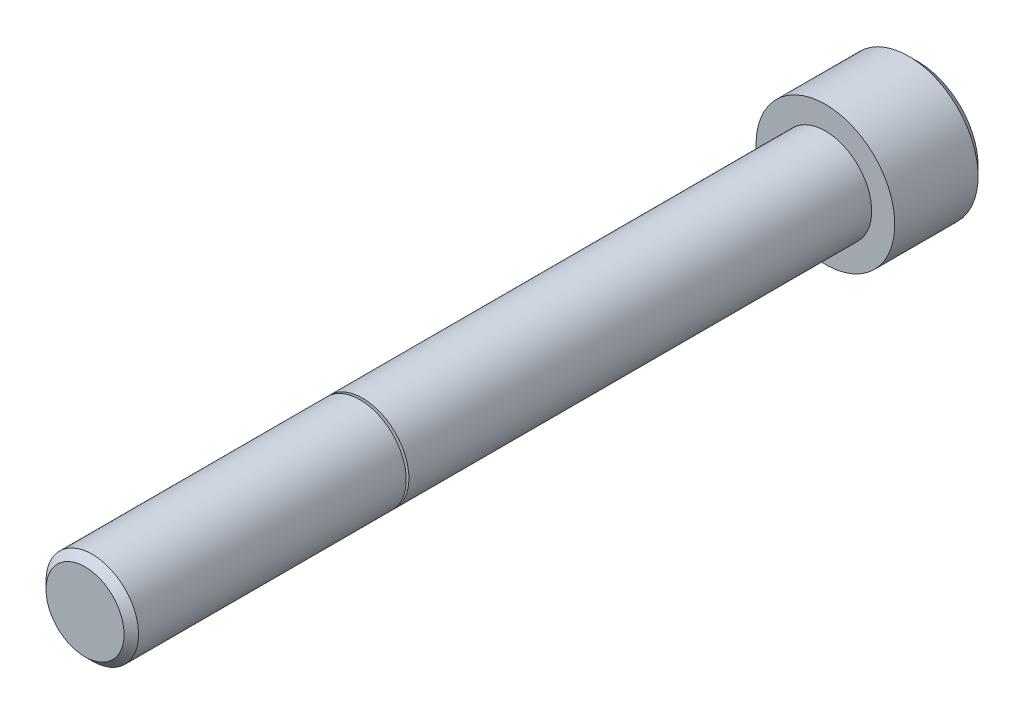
ISO-10303-21;
HEADER;
FILE_DESCRIPTION(('STEP AP214'),'2;1');
FILE_NAME('part.step','',(''),(''),'','','');
FILE_SCHEMA(('AUTOMOTIVE_DESIGN { 1 0 10303 214 1 1 1 1 }'));
ENDSEC;
DATA;
#1=APPLICATION_CONTEXT('core data for automotive mechanical design processes');
#2=APPLICATION_PROTOCOL_DEFINITION('international standard','automotive_design',2000,#1);
#3=PRODUCT_CONTEXT('',#1,'mechanical');
#4=PRODUCT('Part','Part','',(#3));
#5=PRODUCT_RELATED_PRODUCT_CATEGORY('part','',(#4));
#6=PRODUCT_DEFINITION_FORMATION('','',#4);
#7=PRODUCT_DEFINITION_CONTEXT('part definition',#1,'design');
#8=PRODUCT_DEFINITION('design','',#6,#7);
#9=PRODUCT_DEFINITION_SHAPE('','',#8);
#10=(LENGTH_UNIT() NAMED_UNIT(*) SI_UNIT(.MILLI.,.METRE.));
#11=(NAMED_UNIT(*) PLANE_ANGLE_UNIT() SI_UNIT($,.RADIAN.));
#12=(NAMED_UNIT(*) SI_UNIT($,.STERADIAN.) SOLID_ANGLE_UNIT());
#13=UNCERTAINTY_MEASURE_WITH_UNIT(LENGTH_MEASURE(1.E-05),#10,'distance_accuracy_value','');
#14=(GEOMETRIC_REPRESENTATION_CONTEXT(3) GLOBAL_UNCERTAINTY_ASSIGNED_CONTEXT((#13)) GLOBAL_UNIT_ASSIGNED_CONTEXT((#10,
#11,#12)) REPRESENTATION_CONTEXT('',''));
#15=CARTESIAN_POINT('',(0.,0.,0.));
#16=DIRECTION('',(0.,0.,1.));
#17=DIRECTION('',(1.,0.,0.));
#18=AXIS2_PLACEMENT_3D('',#15,#16,#17);
#19=CARTESIAN_POINT('',(0.,0.,-12.7));
#20=DIRECTION('',(0.,0.,1.));
#21=DIRECTION('',(1.,0.,0.));
#22=AXIS2_PLACEMENT_3D('',#19,#20,#21);
#23=PLANE('',#22);
#24=DIRECTION('',(-0.5,-0.866025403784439,0.));
#25=VECTOR('',#24,1.);
#26=CARTESIAN_POINT('',(5.49926131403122,0.,-12.7));
#27=LINE('',#26,#25);
#28=CARTESIAN_POINT('',(5.49926131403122,0.,-12.7));
#29=VERTEX_POINT('',#28);
#30=CARTESIAN_POINT('',(2.74963065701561,-4.7625,-12.7));
#31=VERTEX_POINT('',#30);
#32=EDGE_CURVE('E145',#29,#31,#27,.T.);
#33=ORIENTED_EDGE('',*,*,#32,.F.);
#34=DIRECTION('',(0.5,-0.866025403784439,0.));
#35=VECTOR('',#34,1.);
#36=CARTESIAN_POINT('',(2.74963065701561,4.7625,-12.7));
#37=LINE('',#36,#35);
#38=CARTESIAN_POINT('',(2.74963065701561,4.7625,-12.7));
#39=VERTEX_POINT('',#38);
#40=EDGE_CURVE('E64',#39,#29,#37,.T.);
#41=ORIENTED_EDGE('',*,*,#40,.F.);
#42=DIRECTION('',(1.,0.,0.));
#43=VECTOR('',#42,1.);
#44=CARTESIAN_POINT('',(-2.74963065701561,4.7625,-12.7));
#45=LINE('',#44,#43);
#46=CARTESIAN_POINT('',(-2.74963065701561,4.7625,-12.7));
#47=VERTEX_POINT('',#46);
#48=EDGE_CURVE('E158',#47,#39,#45,.T.);
#49=ORIENTED_EDGE('',*,*,#48,.F.);
#50=DIRECTION('',(0.5,0.866025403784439,0.));
#51=VECTOR('',#50,1.);
#52=CARTESIAN_POINT('',(-5.49926131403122,0.,-12.7));
#53=LINE('',#52,#51);
#54=CARTESIAN_POINT('',(-5.49926131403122,0.,-12.7));
#55=VERTEX_POINT('',#54);
#56=EDGE_CURVE('E155',#55,#47,#53,.T.);
#57=ORIENTED_EDGE('',*,*,#56,.F.);
#58=DIRECTION('',(-0.5,0.866025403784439,0.));
#59=VECTOR('',#58,1.);
#60=CARTESIAN_POINT('',(-2.74963065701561,-4.7625,-12.7));
#61=LINE('',#60,#59);
#62=CARTESIAN_POINT('',(-2.74963065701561,-4.7625,-12.7));
#63=VERTEX_POINT('',#62);
#64=EDGE_CURVE('E112',#63,#55,#61,.T.);
#65=ORIENTED_EDGE('',*,*,#64,.F.);
#66=DIRECTION('',(-1.,0.,0.));
#67=VECTOR('',#66,1.);
#68=CARTESIAN_POINT('',(2.74963065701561,-4.7625,-12.7));
#69=LINE('',#68,#67);
#70=EDGE_CURVE('E149',#31,#63,#69,.T.);
#71=ORIENTED_EDGE('',*,*,#70,.F.);
#72=EDGE_LOOP('',(#33,#41,#49,#57,#65,#71));
#73=FACE_BOUND('',#72,.T.);
#74=CARTESIAN_POINT('',(0.,0.,-12.7));
#75=DIRECTION('',(0.,0.,-1.));
#76=DIRECTION('',(-1.,0.,0.));
#77=AXIS2_PLACEMENT_3D('',#74,#75,#76);
#78=CIRCLE('',#77,8.255);
#79=CARTESIAN_POINT('',(-8.255,0.,-12.7));
#80=VERTEX_POINT('',#79);
#81=EDGE_CURVE('E164',#80,#80,#78,.T.);
#82=ORIENTED_EDGE('',*,*,#81,.T.);
#83=EDGE_LOOP('',(#82));
#84=FACE_BOUND('',#83,.T.);
#85=ADVANCED_FACE('F49',(#73,#84),#23,.F.);
#86=CARTESIAN_POINT('',(-5.35813000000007,0.,101.6));
#87=DIRECTION('',(0.,0.,-1.));
#88=DIRECTION('',(-1.,0.,0.));
#89=AXIS2_PLACEMENT_3D('',#86,#87,#88);
#90=PLANE('',#89);
#91=CARTESIAN_POINT('',(0.,0.,101.6));
#92=DIRECTION('',(0.,0.,-1.));
#93=DIRECTION('',(-1.,0.,0.));
#94=AXIS2_PLACEMENT_3D('',#91,#92,#93);
#95=CIRCLE('',#94,5.35813000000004);
#96=CARTESIAN_POINT('',(-5.35813000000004,0.,101.6));
#97=VERTEX_POINT('',#96);
#98=EDGE_CURVE('E11',#97,#97,#95,.T.);
#99=ORIENTED_EDGE('',*,*,#98,.F.);
#100=EDGE_LOOP('',(#99));
#101=FACE_BOUND('',#100,.T.);
#102=ADVANCED_FACE('F214',(#101),#90,.F.);
#103=CARTESIAN_POINT('',(0.,0.,101.6));
#104=DIRECTION('',(0.,0.,-1.));
#105=DIRECTION('',(-1.,0.,0.));
#106=AXIS2_PLACEMENT_3D('',#103,#104,#105);
#107=CONICAL_SURFACE('',#106,5.35813000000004,0.785398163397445);
#108=CARTESIAN_POINT('',(0.,0.,100.60813));
#109=DIRECTION('',(0.,0.,-1.));
#110=DIRECTION('',(-1.,0.,0.));
#111=AXIS2_PLACEMENT_3D('',#108,#109,#110);
#112=CIRCLE('',#111,6.35000000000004);
#113=CARTESIAN_POINT('',(-6.35000000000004,0.,100.60813));
#114=VERTEX_POINT('',#113);
#115=EDGE_CURVE('E57',#114,#114,#112,.T.);
#116=ORIENTED_EDGE('',*,*,#115,.F.);
#117=EDGE_LOOP('',(#116));
#118=FACE_BOUND('',#117,.T.);
#119=ORIENTED_EDGE('',*,*,#98,.T.);
#120=EDGE_LOOP('',(#119));
#121=FACE_BOUND('',#120,.T.);
#122=ADVANCED_FACE('F211',(#118,#121),#107,.T.);
#123=CARTESIAN_POINT('',(0.,0.,-10.585154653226));
#124=DIRECTION('',(0.,0.,-1.));
#125=DIRECTION('',(-1.,0.,0.));
#126=AXIS2_PLACEMENT_3D('',#123,#124,#125);
#127=CYLINDRICAL_SURFACE('',#126,6.35000000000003);
#128=CARTESIAN_POINT('',(0.,0.,63.8710111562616));
#129=DIRECTION('',(0.,0.,-1.));
#130=DIRECTION('',(-1.,0.,0.));
#131=AXIS2_PLACEMENT_3D('',#128,#129,#130);
#132=CIRCLE('',#131,6.35000000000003);
#133=CARTESIAN_POINT('',(-6.35000000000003,0.,63.8710111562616));
#134=VERTEX_POINT('',#133);
#135=EDGE_CURVE('E201',#134,#134,#132,.T.);
#136=ORIENTED_EDGE('',*,*,#135,.F.);
#137=EDGE_LOOP('',(#136));
#138=FACE_BOUND('',#137,.T.);
#139=ORIENTED_EDGE('',*,*,#115,.T.);
#140=EDGE_LOOP('',(#139));
#141=FACE_BOUND('',#140,.T.);
#142=ADVANCED_FACE('F209',(#138,#141),#127,.T.);
#143=CARTESIAN_POINT('',(0.,0.,63.8710111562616));
#144=DIRECTION('',(0.,0.,1.));
#145=DIRECTION('',(1.,0.,0.));
#146=AXIS2_PLACEMENT_3D('',#143,#144,#145);
#147=CONICAL_SURFACE('',#146,6.35000000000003,1.22173047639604);
#148=CARTESIAN_POINT('',(0.,0.,63.5487938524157));
#149=DIRECTION('',(0.,0.,-1.));
#150=DIRECTION('',(-1.,0.,0.));
#151=AXIS2_PLACEMENT_3D('',#148,#149,#150);
#152=CIRCLE('',#151,5.4647152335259);
#153=CARTESIAN_POINT('',(-5.4647152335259,0.,63.5487938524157));
#154=VERTEX_POINT('',#153);
#155=EDGE_CURVE('E197',#154,#154,#152,.T.);
#156=ORIENTED_EDGE('',*,*,#155,.F.);
#157=EDGE_LOOP('',(#156));
#158=FACE_BOUND('',#157,.T.);
#159=ORIENTED_EDGE('',*,*,#135,.T.);
#160=EDGE_LOOP('',(#159));
#161=FACE_BOUND('',#160,.T.);
#162=ADVANCED_FACE('F226',(#158,#161),#147,.T.);
#163=CARTESIAN_POINT('',(0.,0.,63.53));
#164=DIRECTION('',(0.,0.,-1.));
#165=DIRECTION('',(-1.,0.,0.));
#166=AXIS2_PLACEMENT_3D('',#163,#164,#165);
#167=TOROIDAL_SURFACE('',#166,5.47155563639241,0.0200000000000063);
#168=CARTESIAN_POINT('',(0.,0.,63.51));
#169=DIRECTION('',(0.,0.,-1.));
#170=DIRECTION('',(-1.,0.,0.));
#171=AXIS2_PLACEMENT_3D('',#168,#169,#170);
#172=CIRCLE('',#171,5.47155563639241);
#173=CARTESIAN_POINT('',(-5.47155563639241,0.,63.51));
#174=VERTEX_POINT('',#173);
#175=EDGE_CURVE('E193',#174,#174,#172,.T.);
#176=ORIENTED_EDGE('',*,*,#175,.F.);
#177=EDGE_LOOP('',(#176));
#178=FACE_BOUND('',#177,.T.);
#179=ORIENTED_EDGE('',*,*,#155,.T.);
#180=EDGE_LOOP('',(#179));
#181=FACE_BOUND('',#180,.T.);
#182=ADVANCED_FACE('F230',(#178,#181),#167,.F.);
#183=CARTESIAN_POINT('',(-6.35000000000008,0.,63.51));
#184=DIRECTION('',(0.,0.,-1.));
#185=DIRECTION('',(-1.,0.,0.));
#186=AXIS2_PLACEMENT_3D('',#183,#184,#185);
#187=PLANE('',#186);
#188=CARTESIAN_POINT('',(0.,0.,63.51));
#189=DIRECTION('',(0.,0.,-1.));
#190=DIRECTION('',(-1.,0.,0.));
#191=AXIS2_PLACEMENT_3D('',#188,#189,#190);
#192=CIRCLE('',#191,6.35000000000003);
#193=CARTESIAN_POINT('',(-6.35000000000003,0.,63.51));
#194=VERTEX_POINT('',#193);
#195=EDGE_CURVE('E189',#194,#194,#192,.T.);
#196=ORIENTED_EDGE('',*,*,#195,.F.);
#197=EDGE_LOOP('',(#196));
#198=FACE_BOUND('',#197,.T.);
#199=ORIENTED_EDGE('',*,*,#175,.T.);
#200=EDGE_LOOP('',(#199));
#201=FACE_BOUND('',#200,.T.);
#202=ADVANCED_FACE('F234',(#198,#201),#187,.F.);
#203=CARTESIAN_POINT('',(0.,0.,-10.585154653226));
#204=DIRECTION('',(0.,0.,-1.));
#205=DIRECTION('',(-1.,0.,0.));
#206=AXIS2_PLACEMENT_3D('',#203,#204,#205);
#207=CYLINDRICAL_SURFACE('',#206,6.35000000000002);
#208=CARTESIAN_POINT('',(0.,0.,0.));
#209=DIRECTION('',(0.,0.,-1.));
#210=DIRECTION('',(-1.,0.,0.));
#211=AXIS2_PLACEMENT_3D('',#208,#209,#210);
#212=CIRCLE('',#211,6.35);
#213=CARTESIAN_POINT('',(-6.35,0.,0.));
#214=VERTEX_POINT('',#213);
#215=EDGE_CURVE('E185',#214,#214,#212,.T.);
#216=ORIENTED_EDGE('',*,*,#215,.F.);
#217=EDGE_LOOP('',(#216));
#218=FACE_BOUND('',#217,.T.);
#219=ORIENTED_EDGE('',*,*,#195,.T.);
#220=EDGE_LOOP('',(#219));
#221=FACE_BOUND('',#220,.T.);
#222=ADVANCED_FACE('F238',(#218,#221),#207,.T.);
#223=CARTESIAN_POINT('',(-9.52500000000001,0.,0.));
#224=DIRECTION('',(0.,0.,-1.));
#225=DIRECTION('',(-1.,0.,0.));
#226=AXIS2_PLACEMENT_3D('',#223,#224,#225);
#227=PLANE('',#226);
#228=CARTESIAN_POINT('',(0.,0.,0.));
#229=DIRECTION('',(0.,0.,-1.));
#230=DIRECTION('',(-1.,0.,0.));
#231=AXIS2_PLACEMENT_3D('',#228,#229,#230);
#232=CIRCLE('',#231,9.525);
#233=CARTESIAN_POINT('',(-9.525,0.,0.));
#234=VERTEX_POINT('',#233);
#235=EDGE_CURVE('E181',#234,#234,#232,.T.);
#236=ORIENTED_EDGE('',*,*,#235,.F.);
#237=EDGE_LOOP('',(#236));
#238=FACE_BOUND('',#237,.T.);
#239=ORIENTED_EDGE('',*,*,#215,.T.);
#240=EDGE_LOOP('',(#239));
#241=FACE_BOUND('',#240,.T.);
#242=ADVANCED_FACE('F242',(#238,#241),#227,.F.);
#243=CARTESIAN_POINT('',(0.,0.,-10.585154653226));
#244=DIRECTION('',(0.,0.,-1.));
#245=DIRECTION('',(-1.,0.,0.));
#246=AXIS2_PLACEMENT_3D('',#243,#244,#245);
#247=CYLINDRICAL_SURFACE('',#246,9.525);
#248=CARTESIAN_POINT('',(0.,0.,-11.43));
#249=DIRECTION('',(0.,0.,-1.));
#250=DIRECTION('',(-1.,0.,0.));
#251=AXIS2_PLACEMENT_3D('',#248,#249,#250);
#252=CIRCLE('',#251,9.525);
#253=CARTESIAN_POINT('',(-9.525,0.,-11.43));
#254=VERTEX_POINT('',#253);
#255=EDGE_CURVE('E177',#254,#254,#252,.T.);
#256=ORIENTED_EDGE('',*,*,#255,.F.);
#257=EDGE_LOOP('',(#256));
#258=FACE_BOUND('',#257,.T.);
#259=ORIENTED_EDGE('',*,*,#235,.T.);
#260=EDGE_LOOP('',(#259));
#261=FACE_BOUND('',#260,.T.);
#262=ADVANCED_FACE('F246',(#258,#261),#247,.T.);
#263=CARTESIAN_POINT('',(0.,0.,-11.43));
#264=DIRECTION('',(0.,0.,1.));
#265=DIRECTION('',(1.,0.,0.));
#266=AXIS2_PLACEMENT_3D('',#263,#264,#265);
#267=CONICAL_SURFACE('',#266,9.525,0.785398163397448);
#268=ORIENTED_EDGE('',*,*,#81,.F.);
#269=EDGE_LOOP('',(#268));
#270=FACE_BOUND('',#269,.T.);
#271=ORIENTED_EDGE('',*,*,#255,.T.);
#272=EDGE_LOOP('',(#271));
#273=FACE_BOUND('',#272,.T.);
#274=ADVANCED_FACE('F250',(#270,#273),#267,.T.);
#275=CARTESIAN_POINT('',(2.74963065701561,4.7625,-6.35));
#276=DIRECTION('',(0.866025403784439,0.5,0.));
#277=DIRECTION('',(-0.5,0.866025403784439,0.));
#278=AXIS2_PLACEMENT_3D('',#275,#276,#277);
#279=PLANE('',#278);
#280=ORIENTED_EDGE('',*,*,#40,.T.);
#281=DIRECTION('',(0.,0.,-1.));
#282=VECTOR('',#281,1.);
#283=CARTESIAN_POINT('',(5.49926131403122,0.,-6.35));
#284=LINE('',#283,#282);
#285=CARTESIAN_POINT('',(5.49926131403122,0.,-6.35));
#286=VERTEX_POINT('',#285);
#287=EDGE_CURVE('E94',#286,#29,#284,.T.);
#288=ORIENTED_EDGE('',*,*,#287,.F.);
#289=DIRECTION('',(0.5,-0.866025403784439,0.));
#290=VECTOR('',#289,1.);
#291=CARTESIAN_POINT('',(2.74963065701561,4.7625,-6.35));
#292=LINE('',#291,#290);
#293=CARTESIAN_POINT('',(2.74963065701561,4.7625,-6.35));
#294=VERTEX_POINT('',#293);
#295=EDGE_CURVE('E161',#294,#286,#292,.T.);
#296=ORIENTED_EDGE('',*,*,#295,.F.);
#297=DIRECTION('',(0.,0.,-1.));
#298=VECTOR('',#297,1.);
#299=CARTESIAN_POINT('',(2.74963065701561,4.7625,-6.35));
#300=LINE('',#299,#298);
#301=EDGE_CURVE('E72',#294,#39,#300,.T.);
#302=ORIENTED_EDGE('',*,*,#301,.T.);
#303=EDGE_LOOP('',(#280,#288,#296,#302));
#304=FACE_BOUND('',#303,.T.);
#305=ADVANCED_FACE('F254',(#304),#279,.F.);
#306=CARTESIAN_POINT('',(-2.74963065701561,4.7625,-6.35));
#307=DIRECTION('',(0.,1.,0.));
#308=DIRECTION('',(0.,0.,1.));
#309=AXIS2_PLACEMENT_3D('',#306,#307,#308);
#310=PLANE('',#309);
#311=ORIENTED_EDGE('',*,*,#48,.T.);
#312=ORIENTED_EDGE('',*,*,#301,.F.);
#313=DIRECTION('',(1.,0.,0.));
#314=VECTOR('',#313,1.);
#315=CARTESIAN_POINT('',(-2.74963065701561,4.7625,-6.35));
#316=LINE('',#315,#314);
#317=CARTESIAN_POINT('',(-2.74963065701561,4.7625,-6.35));
#318=VERTEX_POINT('',#317);
#319=EDGE_CURVE('E126',#318,#294,#316,.T.);
#320=ORIENTED_EDGE('',*,*,#319,.F.);
#321=DIRECTION('',(0.,0.,-1.));
#322=VECTOR('',#321,1.);
#323=CARTESIAN_POINT('',(-2.74963065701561,4.7625,-6.35));
#324=LINE('',#323,#322);
#325=EDGE_CURVE('E117',#318,#47,#324,.T.);
#326=ORIENTED_EDGE('',*,*,#325,.T.);
#327=EDGE_LOOP('',(#311,#312,#320,#326));
#328=FACE_BOUND('',#327,.T.);
#329=ADVANCED_FACE('F258',(#328),#310,.F.);
#330=CARTESIAN_POINT('',(-5.49926131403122,0.,-6.35));
#331=DIRECTION('',(-0.866025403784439,0.5,0.));
#332=DIRECTION('',(-0.5,-0.866025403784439,0.));
#333=AXIS2_PLACEMENT_3D('',#330,#331,#332);
#334=PLANE('',#333);
#335=ORIENTED_EDGE('',*,*,#56,.T.);
#336=ORIENTED_EDGE('',*,*,#325,.F.);
#337=DIRECTION('',(0.5,0.866025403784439,0.));
#338=VECTOR('',#337,1.);
#339=CARTESIAN_POINT('',(-5.49926131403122,0.,-6.35));
#340=LINE('',#339,#338);
#341=CARTESIAN_POINT('',(-5.49926131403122,0.,-6.35));
#342=VERTEX_POINT('',#341);
#343=EDGE_CURVE('E121',#342,#318,#340,.T.);
#344=ORIENTED_EDGE('',*,*,#343,.F.);
#345=DIRECTION('',(0.,0.,-1.));
#346=VECTOR('',#345,1.);
#347=CARTESIAN_POINT('',(-5.49926131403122,0.,-6.35));
#348=LINE('',#347,#346);
#349=EDGE_CURVE('E105',#342,#55,#348,.T.);
#350=ORIENTED_EDGE('',*,*,#349,.T.);
#351=EDGE_LOOP('',(#335,#336,#344,#350));
#352=FACE_BOUND('',#351,.T.);
#353=ADVANCED_FACE('F122',(#352),#334,.F.);
#354=CARTESIAN_POINT('',(-2.74963065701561,-4.7625,-6.35));
#355=DIRECTION('',(-0.866025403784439,-0.5,0.));
#356=DIRECTION('',(0.5,-0.866025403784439,0.));
#357=AXIS2_PLACEMENT_3D('',#354,#355,#356);
#358=PLANE('',#357);
#359=ORIENTED_EDGE('',*,*,#64,.T.);
#360=ORIENTED_EDGE('',*,*,#349,.F.);
#361=DIRECTION('',(-0.5,0.866025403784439,0.));
#362=VECTOR('',#361,1.);
#363=CARTESIAN_POINT('',(-2.74963065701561,-4.7625,-6.35));
#364=LINE('',#363,#362);
#365=CARTESIAN_POINT('',(-2.74963065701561,-4.7625,-6.35));
#366=VERTEX_POINT('',#365);
#367=EDGE_CURVE('E109',#366,#342,#364,.T.);
#368=ORIENTED_EDGE('',*,*,#367,.F.);
#369=DIRECTION('',(0.,0.,-1.));
#370=VECTOR('',#369,1.);
#371=CARTESIAN_POINT('',(-2.74963065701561,-4.7625,-6.35));
#372=LINE('',#371,#370);
#373=EDGE_CURVE('E118',#366,#63,#372,.T.);
#374=ORIENTED_EDGE('',*,*,#373,.T.);
#375=EDGE_LOOP('',(#359,#360,#368,#374));
#376=FACE_BOUND('',#375,.T.);
#377=ADVANCED_FACE('F107',(#376),#358,.F.);
#378=CARTESIAN_POINT('',(2.74963065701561,-4.7625,-6.35));
#379=DIRECTION('',(0.,-1.,0.));
#380=DIRECTION('',(0.,0.,-1.));
#381=AXIS2_PLACEMENT_3D('',#378,#379,#380);
#382=PLANE('',#381);
#383=ORIENTED_EDGE('',*,*,#70,.T.);
#384=ORIENTED_EDGE('',*,*,#373,.F.);
#385=DIRECTION('',(-1.,0.,0.));
#386=VECTOR('',#385,1.);
#387=CARTESIAN_POINT('',(2.74963065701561,-4.7625,-6.35));
#388=LINE('',#387,#386);
#389=CARTESIAN_POINT('',(2.74963065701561,-4.7625,-6.35));
#390=VERTEX_POINT('',#389);
#391=EDGE_CURVE('E132',#390,#366,#388,.T.);
#392=ORIENTED_EDGE('',*,*,#391,.F.);
#393=DIRECTION('',(0.,0.,-1.));
#394=VECTOR('',#393,1.);
#395=CARTESIAN_POINT('',(2.74963065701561,-4.7625,-6.35));
#396=LINE('',#395,#394);
#397=EDGE_CURVE('E169',#390,#31,#396,.T.);
#398=ORIENTED_EDGE('',*,*,#397,.T.);
#399=EDGE_LOOP('',(#383,#384,#392,#398));
#400=FACE_BOUND('',#399,.T.);
#401=ADVANCED_FACE('F262',(#400),#382,.F.);
#402=CARTESIAN_POINT('',(5.49926131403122,0.,-6.35));
#403=DIRECTION('',(0.866025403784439,-0.5,0.));
#404=DIRECTION('',(0.5,0.866025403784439,0.));
#405=AXIS2_PLACEMENT_3D('',#402,#403,#404);
#406=PLANE('',#405);
#407=ORIENTED_EDGE('',*,*,#32,.T.);
#408=ORIENTED_EDGE('',*,*,#397,.F.);
#409=DIRECTION('',(-0.5,-0.866025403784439,0.));
#410=VECTOR('',#409,1.);
#411=CARTESIAN_POINT('',(5.49926131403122,0.,-6.35));
#412=LINE('',#411,#410);
#413=EDGE_CURVE('E137',#286,#390,#412,.T.);
#414=ORIENTED_EDGE('',*,*,#413,.F.);
#415=ORIENTED_EDGE('',*,*,#287,.T.);
#416=EDGE_LOOP('',(#407,#408,#414,#415));
#417=FACE_BOUND('',#416,.T.);
#418=ADVANCED_FACE('F259',(#417),#406,.F.);
#419=CARTESIAN_POINT('',(8.24889197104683,-4.7625,-6.35));
#420=DIRECTION('',(0.,0.,-1.));
#421=DIRECTION('',(-1.,0.,0.));
#422=AXIS2_PLACEMENT_3D('',#419,#420,#421);
#423=PLANE('',#422);
#424=ORIENTED_EDGE('',*,*,#295,.T.);
#425=ORIENTED_EDGE('',*,*,#413,.T.);
#426=ORIENTED_EDGE('',*,*,#391,.T.);
#427=ORIENTED_EDGE('',*,*,#367,.T.);
#428=ORIENTED_EDGE('',*,*,#343,.T.);
#429=ORIENTED_EDGE('',*,*,#319,.T.);
#430=EDGE_LOOP('',(#424,#425,#426,#427,#428,#429));
#431=FACE_BOUND('',#430,.T.);
#432=ADVANCED_FACE('F129',(#431),#423,.T.);
#433=CLOSED_SHELL('',(#85,#102,#122,#142,#162,#182,#202,#222,#242,#262,#274,#305,#329,#353,#377,
#401,#418,#432));
#434=MANIFOLD_SOLID_BREP('B2',#433);
#435=ADVANCED_BREP_SHAPE_REPRESENTATION('',(#18,#434),#14);
#436=SHAPE_DEFINITION_REPRESENTATION(#9,#435);
ENDSEC;
END-ISO-10303-21;
